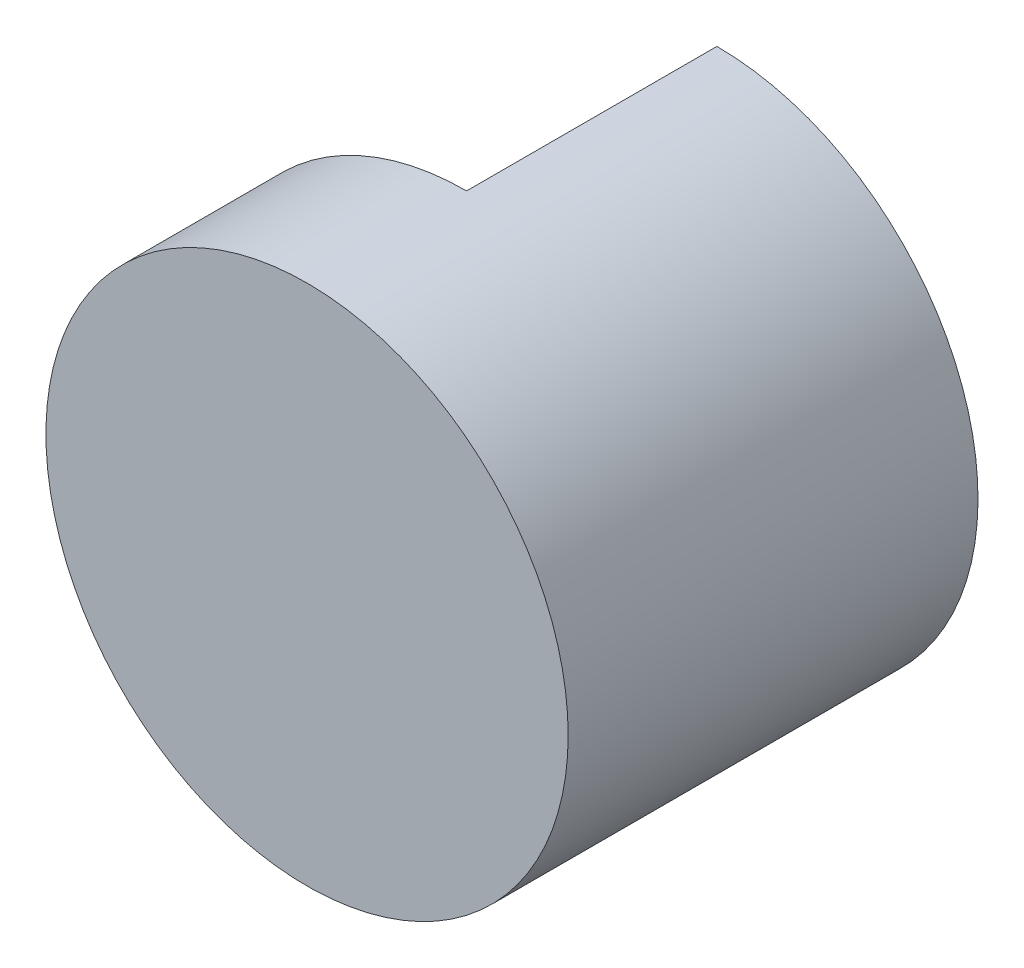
ISO-10303-21;
HEADER;
FILE_DESCRIPTION(('STEP AP214'),'2;1');
FILE_NAME('part.step','',(''),(''),'','','');
FILE_SCHEMA(('AUTOMOTIVE_DESIGN { 1 0 10303 214 1 1 1 1 }'));
ENDSEC;
DATA;
#1=APPLICATION_CONTEXT('core data for automotive mechanical design processes');
#2=APPLICATION_PROTOCOL_DEFINITION('international standard','automotive_design',2000,#1);
#3=PRODUCT_CONTEXT('',#1,'mechanical');
#4=PRODUCT('Part','Part','',(#3));
#5=PRODUCT_RELATED_PRODUCT_CATEGORY('part','',(#4));
#6=PRODUCT_DEFINITION_FORMATION('','',#4);
#7=PRODUCT_DEFINITION_CONTEXT('part definition',#1,'design');
#8=PRODUCT_DEFINITION('design','',#6,#7);
#9=PRODUCT_DEFINITION_SHAPE('','',#8);
#10=(LENGTH_UNIT() NAMED_UNIT(*) SI_UNIT(.MILLI.,.METRE.));
#11=(NAMED_UNIT(*) PLANE_ANGLE_UNIT() SI_UNIT($,.RADIAN.));
#12=(NAMED_UNIT(*) SI_UNIT($,.STERADIAN.) SOLID_ANGLE_UNIT());
#13=UNCERTAINTY_MEASURE_WITH_UNIT(LENGTH_MEASURE(1.E-05),#10,'distance_accuracy_value','');
#14=(GEOMETRIC_REPRESENTATION_CONTEXT(3) GLOBAL_UNCERTAINTY_ASSIGNED_CONTEXT((#13)) GLOBAL_UNIT_ASSIGNED_CONTEXT((#10,
#11,#12)) REPRESENTATION_CONTEXT('',''));
#15=CARTESIAN_POINT('',(0.,0.,0.));
#16=DIRECTION('',(0.,0.,1.));
#17=DIRECTION('',(1.,0.,0.));
#18=AXIS2_PLACEMENT_3D('',#15,#16,#17);
#19=CARTESIAN_POINT('',(0.,0.,15.3925));
#20=DIRECTION('',(0.,0.,-1.));
#21=DIRECTION('',(-1.,0.,0.));
#22=AXIS2_PLACEMENT_3D('',#19,#20,#21);
#23=CYLINDRICAL_SURFACE('',#22,15.649915);
#24=CARTESIAN_POINT('',(0.,0.,24.5625));
#25=DIRECTION('',(0.,0.,1.));
#26=DIRECTION('',(1.,0.,0.));
#27=AXIS2_PLACEMENT_3D('',#24,#25,#26);
#28=CIRCLE('',#27,15.649915);
#29=CARTESIAN_POINT('',(15.649915,0.,24.5625));
#30=VERTEX_POINT('',#29);
#31=EDGE_CURVE('E98',#30,#30,#28,.T.);
#32=ORIENTED_EDGE('',*,*,#31,.F.);
#33=EDGE_LOOP('',(#32));
#34=FACE_BOUND('',#33,.T.);
#35=DIRECTION('',(0.,0.,-1.));
#36=VECTOR('',#35,1.);
#37=CARTESIAN_POINT('',(0.,15.649915,15.3925));
#38=LINE('',#37,#36);
#39=CARTESIAN_POINT('',(0.,15.649915,15.));
#40=VERTEX_POINT('',#39);
#41=CARTESIAN_POINT('',(0.,15.649915,0.));
#42=VERTEX_POINT('',#41);
#43=EDGE_CURVE('E93',#40,#42,#38,.T.);
#44=ORIENTED_EDGE('',*,*,#43,.F.);
#45=CARTESIAN_POINT('',(0.,0.,15.));
#46=DIRECTION('',(0.,0.,-1.));
#47=DIRECTION('',(-1.,0.,0.));
#48=AXIS2_PLACEMENT_3D('',#45,#46,#47);
#49=CIRCLE('',#48,15.649915);
#50=CARTESIAN_POINT('',(-13.9441763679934,-7.10491273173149,15.));
#51=VERTEX_POINT('',#50);
#52=EDGE_CURVE('E11',#51,#40,#49,.T.);
#53=ORIENTED_EDGE('',*,*,#52,.F.);
#54=DIRECTION('',(0.,0.,-1.));
#55=VECTOR('',#54,1.);
#56=CARTESIAN_POINT('',(-13.9441763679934,-7.10491273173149,15.3925));
#57=LINE('',#56,#55);
#58=CARTESIAN_POINT('',(-13.9441763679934,-7.10491273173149,0.));
#59=VERTEX_POINT('',#58);
#60=EDGE_CURVE('E78',#51,#59,#57,.T.);
#61=ORIENTED_EDGE('',*,*,#60,.T.);
#62=CARTESIAN_POINT('',(0.,0.,0.));
#63=DIRECTION('',(0.,0.,1.));
#64=DIRECTION('',(1.,0.,0.));
#65=AXIS2_PLACEMENT_3D('',#62,#63,#64);
#66=CIRCLE('',#65,15.649915);
#67=EDGE_CURVE('E101',#59,#42,#66,.T.);
#68=ORIENTED_EDGE('',*,*,#67,.T.);
#69=EDGE_LOOP('',(#44,#53,#61,#68));
#70=FACE_BOUND('',#69,.T.);
#71=ADVANCED_FACE('F35',(#34,#70),#23,.T.);
#72=CARTESIAN_POINT('',(0.,0.,0.));
#73=DIRECTION('',(0.,0.,1.));
#74=DIRECTION('',(1.,0.,0.));
#75=AXIS2_PLACEMENT_3D('',#72,#73,#74);
#76=PLANE('',#75);
#77=DIRECTION('',(0.,1.,0.));
#78=VECTOR('',#77,1.);
#79=CARTESIAN_POINT('',(0.,0.,0.));
#80=LINE('',#79,#78);
#81=CARTESIAN_POINT('',(0.,13.1,0.));
#82=VERTEX_POINT('',#81);
#83=EDGE_CURVE('E88',#82,#42,#80,.T.);
#84=ORIENTED_EDGE('',*,*,#83,.T.);
#85=ORIENTED_EDGE('',*,*,#67,.F.);
#86=DIRECTION('',(-0.891006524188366,-0.453990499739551,0.));
#87=VECTOR('',#86,1.);
#88=CARTESIAN_POINT('',(0.,0.,0.));
#89=LINE('',#88,#87);
#90=CARTESIAN_POINT('',(-11.6721854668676,-5.94727554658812,0.));
#91=VERTEX_POINT('',#90);
#92=EDGE_CURVE('E82',#91,#59,#89,.T.);
#93=ORIENTED_EDGE('',*,*,#92,.F.);
#94=CARTESIAN_POINT('',(0.,0.,0.));
#95=DIRECTION('',(0.,0.,1.));
#96=DIRECTION('',(1.,0.,0.));
#97=AXIS2_PLACEMENT_3D('',#94,#95,#96);
#98=CIRCLE('',#97,13.1);
#99=EDGE_CURVE('E95',#91,#82,#98,.T.);
#100=ORIENTED_EDGE('',*,*,#99,.T.);
#101=EDGE_LOOP('',(#84,#85,#93,#100));
#102=FACE_BOUND('',#101,.T.);
#103=ADVANCED_FACE('F111',(#102),#76,.F.);
#104=CARTESIAN_POINT('',(0.,0.,9.825));
#105=DIRECTION('',(0.,0.,-1.));
#106=DIRECTION('',(-1.,0.,0.));
#107=AXIS2_PLACEMENT_3D('',#104,#105,#106);
#108=CONICAL_SURFACE('',#107,0.,0.927295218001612);
#109=DIRECTION('',(0.,0.8,-0.6));
#110=VECTOR('',#109,1.);
#111=CARTESIAN_POINT('',(0.,0.,9.825));
#112=LINE('',#111,#110);
#113=CARTESIAN_POINT('',(0.,0.,9.825));
#114=VERTEX_POINT('',#113);
#115=EDGE_CURVE('E42',#82,#114,#112,.F.);
#116=ORIENTED_EDGE('',*,*,#115,.F.);
#117=ORIENTED_EDGE('',*,*,#99,.F.);
#118=DIRECTION('',(-0.712805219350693,-0.363192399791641,-0.6));
#119=VECTOR('',#118,1.);
#120=CARTESIAN_POINT('',(0.,0.,9.825));
#121=LINE('',#120,#119);
#122=EDGE_CURVE('E104',#91,#114,#121,.F.);
#123=ORIENTED_EDGE('',*,*,#122,.T.);
#124=EDGE_LOOP('',(#116,#117,#123));
#125=FACE_BOUND('',#124,.T.);
#126=ADVANCED_FACE('F107',(#125),#108,.F.);
#127=CARTESIAN_POINT('',(0.,0.,24.5625));
#128=DIRECTION('',(0.,0.,1.));
#129=DIRECTION('',(1.,0.,0.));
#130=AXIS2_PLACEMENT_3D('',#127,#128,#129);
#131=PLANE('',#130);
#132=ORIENTED_EDGE('',*,*,#31,.T.);
#133=EDGE_LOOP('',(#132));
#134=FACE_BOUND('',#133,.T.);
#135=ADVANCED_FACE('F120',(#134),#131,.T.);
#136=CARTESIAN_POINT('',(0.,0.,15.));
#137=DIRECTION('',(0.,0.,-1.));
#138=DIRECTION('',(-1.,0.,0.));
#139=AXIS2_PLACEMENT_3D('',#136,#137,#138);
#140=PLANE('',#139);
#141=ORIENTED_EDGE('',*,*,#52,.T.);
#142=DIRECTION('',(0.,1.,0.));
#143=VECTOR('',#142,1.);
#144=CARTESIAN_POINT('',(0.,0.,15.));
#145=LINE('',#144,#143);
#146=CARTESIAN_POINT('',(0.,0.,15.));
#147=VERTEX_POINT('',#146);
#148=EDGE_CURVE('E74',#147,#40,#145,.T.);
#149=ORIENTED_EDGE('',*,*,#148,.F.);
#150=DIRECTION('',(-0.891006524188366,-0.453990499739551,0.));
#151=VECTOR('',#150,1.);
#152=CARTESIAN_POINT('',(0.,0.,15.));
#153=LINE('',#152,#151);
#154=EDGE_CURVE('E79',#147,#51,#153,.T.);
#155=ORIENTED_EDGE('',*,*,#154,.T.);
#156=EDGE_LOOP('',(#141,#149,#155));
#157=FACE_BOUND('',#156,.T.);
#158=ADVANCED_FACE('F81',(#157),#140,.T.);
#159=CARTESIAN_POINT('',(0.,0.,15.));
#160=DIRECTION('',(-1.,0.,0.));
#161=DIRECTION('',(0.,0.,1.));
#162=AXIS2_PLACEMENT_3D('',#159,#160,#161);
#163=PLANE('',#162);
#164=ORIENTED_EDGE('',*,*,#43,.T.);
#165=ORIENTED_EDGE('',*,*,#83,.F.);
#166=ORIENTED_EDGE('',*,*,#115,.T.);
#167=DIRECTION('',(0.,0.,-1.));
#168=VECTOR('',#167,1.);
#169=CARTESIAN_POINT('',(0.,0.,15.));
#170=LINE('',#169,#168);
#171=EDGE_CURVE('E49',#147,#114,#170,.T.);
#172=ORIENTED_EDGE('',*,*,#171,.F.);
#173=ORIENTED_EDGE('',*,*,#148,.T.);
#174=EDGE_LOOP('',(#164,#165,#166,#172,#173));
#175=FACE_BOUND('',#174,.T.);
#176=ADVANCED_FACE('F73',(#175),#163,.T.);
#177=CARTESIAN_POINT('',(0.,0.,15.));
#178=DIRECTION('',(0.453990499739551,-0.891006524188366,0.));
#179=DIRECTION('',(0.891006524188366,0.453990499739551,0.));
#180=AXIS2_PLACEMENT_3D('',#177,#178,#179);
#181=PLANE('',#180);
#182=ORIENTED_EDGE('',*,*,#154,.F.);
#183=ORIENTED_EDGE('',*,*,#171,.T.);
#184=ORIENTED_EDGE('',*,*,#122,.F.);
#185=ORIENTED_EDGE('',*,*,#92,.T.);
#186=ORIENTED_EDGE('',*,*,#60,.F.);
#187=EDGE_LOOP('',(#182,#183,#184,#185,#186));
#188=FACE_BOUND('',#187,.T.);
#189=ADVANCED_FACE('F84',(#188),#181,.F.);
#190=CLOSED_SHELL('',(#71,#103,#126,#135,#158,#176,#189));
#191=MANIFOLD_SOLID_BREP('B2',#190);
#192=ADVANCED_BREP_SHAPE_REPRESENTATION('',(#18,#191),#14);
#193=SHAPE_DEFINITION_REPRESENTATION(#9,#192);
ENDSEC;
END-ISO-10303-21;
